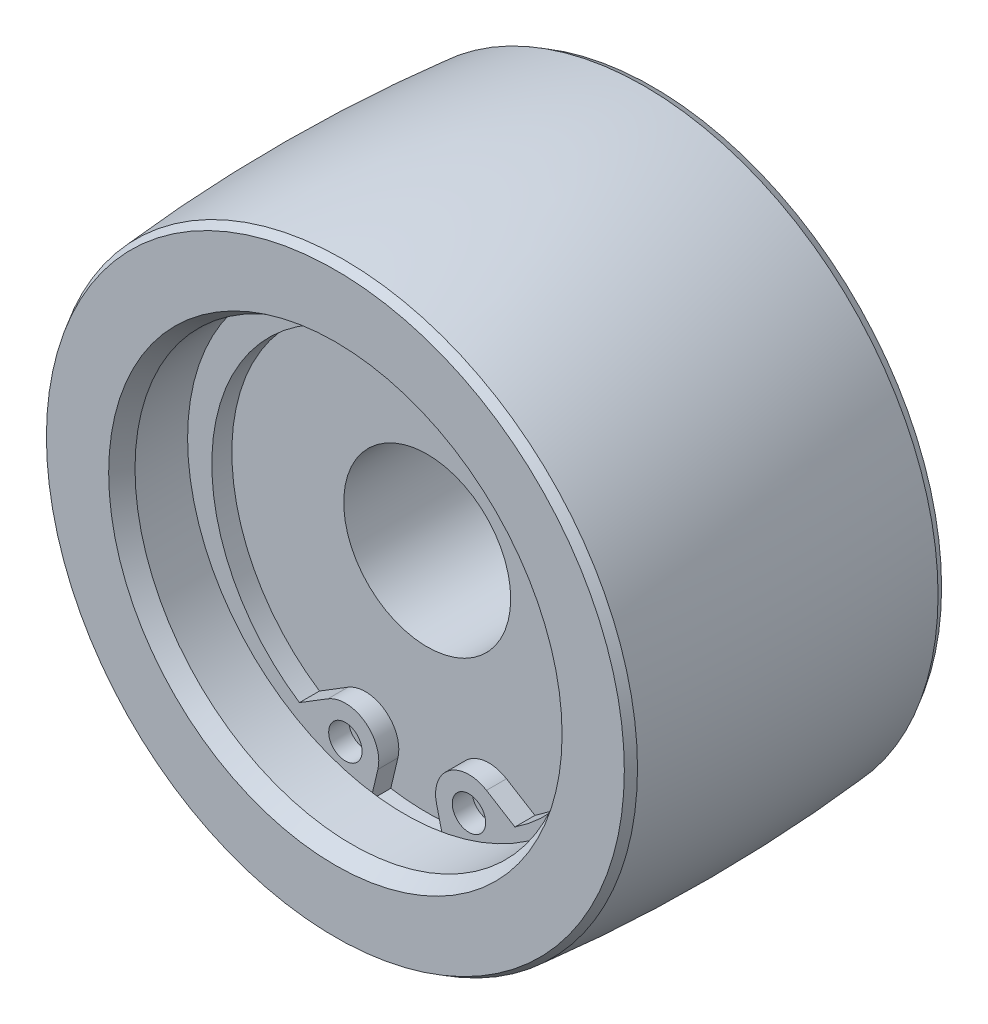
ISO-10303-21;
HEADER;
FILE_DESCRIPTION(('STEP AP214'),'2;1');
FILE_NAME('part.step','',(''),(''),'','','');
FILE_SCHEMA(('AUTOMOTIVE_DESIGN { 1 0 10303 214 1 1 1 1 }'));
ENDSEC;
DATA;
#1=APPLICATION_CONTEXT('core data for automotive mechanical design processes');
#2=APPLICATION_PROTOCOL_DEFINITION('international standard','automotive_design',2000,#1);
#3=PRODUCT_CONTEXT('',#1,'mechanical');
#4=PRODUCT('Part','Part','',(#3));
#5=PRODUCT_RELATED_PRODUCT_CATEGORY('part','',(#4));
#6=PRODUCT_DEFINITION_FORMATION('','',#4);
#7=PRODUCT_DEFINITION_CONTEXT('part definition',#1,'design');
#8=PRODUCT_DEFINITION('design','',#6,#7);
#9=PRODUCT_DEFINITION_SHAPE('','',#8);
#10=(LENGTH_UNIT() NAMED_UNIT(*) SI_UNIT(.MILLI.,.METRE.));
#11=(NAMED_UNIT(*) PLANE_ANGLE_UNIT() SI_UNIT($,.RADIAN.));
#12=(NAMED_UNIT(*) SI_UNIT($,.STERADIAN.) SOLID_ANGLE_UNIT());
#13=UNCERTAINTY_MEASURE_WITH_UNIT(LENGTH_MEASURE(1.E-05),#10,'distance_accuracy_value','');
#14=(GEOMETRIC_REPRESENTATION_CONTEXT(3) GLOBAL_UNCERTAINTY_ASSIGNED_CONTEXT((#13)) GLOBAL_UNIT_ASSIGNED_CONTEXT((#10,
#11,#12)) REPRESENTATION_CONTEXT('',''));
#15=CARTESIAN_POINT('',(0.,0.,0.));
#16=DIRECTION('',(0.,0.,1.));
#17=DIRECTION('',(1.,0.,0.));
#18=AXIS2_PLACEMENT_3D('',#15,#16,#17);
#19=CARTESIAN_POINT('',(0.,0.,0.));
#20=DIRECTION('',(0.,0.,-1.));
#21=DIRECTION('',(-1.,0.,0.));
#22=AXIS2_PLACEMENT_3D('',#19,#20,#21);
#23=DEGENERATE_TOROIDAL_SURFACE('',#22,82.,100.,.F.);
#24=CARTESIAN_POINT('',(0.,0.,-8.99999999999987));
#25=DIRECTION('',(0.,0.,-1.));
#26=DIRECTION('',(-1.,0.,0.));
#27=AXIS2_PLACEMENT_3D('',#24,#25,#26);
#28=CIRCLE('',#27,17.5941765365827);
#29=CARTESIAN_POINT('',(-17.5941765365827,0.,-8.99999999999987));
#30=VERTEX_POINT('',#29);
#31=EDGE_CURVE('E186',#30,#30,#28,.F.);
#32=ORIENTED_EDGE('',*,*,#31,.T.);
#33=EDGE_LOOP('',(#32));
#34=FACE_BOUND('',#33,.T.);
#35=CARTESIAN_POINT('',(0.,0.,9.));
#36=DIRECTION('',(0.,0.,1.));
#37=DIRECTION('',(1.,0.,0.));
#38=AXIS2_PLACEMENT_3D('',#35,#36,#37);
#39=CIRCLE('',#38,17.5941765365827);
#40=CARTESIAN_POINT('',(17.5941765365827,0.,9.));
#41=VERTEX_POINT('',#40);
#42=EDGE_CURVE('E190',#41,#41,#39,.F.);
#43=ORIENTED_EDGE('',*,*,#42,.T.);
#44=EDGE_LOOP('',(#43));
#45=FACE_BOUND('',#44,.T.);
#46=ADVANCED_FACE('F14',(#34,#45),#23,.F.);
#47=CARTESIAN_POINT('',(0.,0.,-8.49999999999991));
#48=DIRECTION('',(0.,0.,1.));
#49=DIRECTION('',(1.,0.,0.));
#50=AXIS2_PLACEMENT_3D('',#47,#48,#49);
#51=CONICAL_SURFACE('',#50,17.8828516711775,0.523598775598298);
#52=CARTESIAN_POINT('',(0.,0.,-9.5));
#53=DIRECTION('',(0.,0.,-1.));
#54=DIRECTION('',(-1.,0.,0.));
#55=AXIS2_PLACEMENT_3D('',#52,#53,#54);
#56=CIRCLE('',#55,17.3055014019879);
#57=CARTESIAN_POINT('',(-17.3055014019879,0.,-9.5));
#58=VERTEX_POINT('',#57);
#59=EDGE_CURVE('E183',#58,#58,#56,.T.);
#60=ORIENTED_EDGE('',*,*,#59,.F.);
#61=EDGE_LOOP('',(#60));
#62=FACE_BOUND('',#61,.T.);
#63=ORIENTED_EDGE('',*,*,#31,.F.);
#64=EDGE_LOOP('',(#63));
#65=FACE_BOUND('',#64,.T.);
#66=ADVANCED_FACE('F213',(#62,#65),#51,.T.);
#67=CARTESIAN_POINT('',(0.,0.,9.5));
#68=DIRECTION('',(0.,0.,-1.));
#69=DIRECTION('',(-1.,0.,0.));
#70=AXIS2_PLACEMENT_3D('',#67,#68,#69);
#71=CONICAL_SURFACE('',#70,17.3055014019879,0.523598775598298);
#72=CARTESIAN_POINT('',(0.,0.,9.5));
#73=DIRECTION('',(0.,0.,-1.));
#74=DIRECTION('',(-1.,0.,0.));
#75=AXIS2_PLACEMENT_3D('',#72,#73,#74);
#76=CIRCLE('',#75,17.3055014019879);
#77=CARTESIAN_POINT('',(-17.3055014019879,0.,9.5));
#78=VERTEX_POINT('',#77);
#79=EDGE_CURVE('E187',#78,#78,#76,.T.);
#80=ORIENTED_EDGE('',*,*,#79,.T.);
#81=EDGE_LOOP('',(#80));
#82=FACE_BOUND('',#81,.T.);
#83=ORIENTED_EDGE('',*,*,#42,.F.);
#84=EDGE_LOOP('',(#83));
#85=FACE_BOUND('',#84,.T.);
#86=ADVANCED_FACE('F215',(#82,#85),#71,.T.);
#87=CARTESIAN_POINT('',(0.,0.,-9.5));
#88=DIRECTION('',(0.,0.,1.));
#89=DIRECTION('',(1.,0.,0.));
#90=AXIS2_PLACEMENT_3D('',#87,#88,#89);
#91=PLANE('',#90);
#92=ORIENTED_EDGE('',*,*,#59,.T.);
#93=EDGE_LOOP('',(#92));
#94=FACE_BOUND('',#93,.T.);
#95=CARTESIAN_POINT('',(0.,0.,-9.5));
#96=DIRECTION('',(0.,0.,-1.));
#97=DIRECTION('',(-1.,0.,0.));
#98=AXIS2_PLACEMENT_3D('',#95,#96,#97);
#99=CIRCLE('',#98,11.);
#100=CARTESIAN_POINT('',(-11.,0.,-9.5));
#101=VERTEX_POINT('',#100);
#102=EDGE_CURVE('E203',#101,#101,#99,.T.);
#103=ORIENTED_EDGE('',*,*,#102,.F.);
#104=EDGE_LOOP('',(#103));
#105=FACE_BOUND('',#104,.T.);
#106=ADVANCED_FACE('F223',(#94,#105),#91,.F.);
#107=CARTESIAN_POINT('',(0.,0.,9.5));
#108=DIRECTION('',(0.,0.,1.));
#109=DIRECTION('',(1.,0.,0.));
#110=AXIS2_PLACEMENT_3D('',#107,#108,#109);
#111=PLANE('',#110);
#112=ORIENTED_EDGE('',*,*,#79,.F.);
#113=EDGE_LOOP('',(#112));
#114=FACE_BOUND('',#113,.T.);
#115=CARTESIAN_POINT('',(0.,0.,9.5));
#116=DIRECTION('',(0.,0.,-1.));
#117=DIRECTION('',(-1.,0.,0.));
#118=AXIS2_PLACEMENT_3D('',#115,#116,#117);
#119=CIRCLE('',#118,13.5773502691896);
#120=CARTESIAN_POINT('',(-13.5773502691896,0.,9.5));
#121=VERTEX_POINT('',#120);
#122=EDGE_CURVE('E191',#121,#121,#119,.T.);
#123=ORIENTED_EDGE('',*,*,#122,.T.);
#124=EDGE_LOOP('',(#123));
#125=FACE_BOUND('',#124,.T.);
#126=ADVANCED_FACE('F306',(#114,#125),#111,.T.);
#127=CARTESIAN_POINT('',(0.,0.,-10.45));
#128=DIRECTION('',(0.,0.,-1.));
#129=DIRECTION('',(-1.,0.,0.));
#130=AXIS2_PLACEMENT_3D('',#127,#128,#129);
#131=CYLINDRICAL_SURFACE('',#130,11.);
#132=CARTESIAN_POINT('',(0.,0.,-4.));
#133=DIRECTION('',(0.,0.,1.));
#134=DIRECTION('',(1.,0.,0.));
#135=AXIS2_PLACEMENT_3D('',#132,#133,#134);
#136=CIRCLE('',#135,11.);
#137=CARTESIAN_POINT('',(11.,0.,-4.));
#138=VERTEX_POINT('',#137);
#139=EDGE_CURVE('E174',#138,#138,#136,.T.);
#140=ORIENTED_EDGE('',*,*,#139,.T.);
#141=EDGE_LOOP('',(#140));
#142=FACE_BOUND('',#141,.T.);
#143=ORIENTED_EDGE('',*,*,#102,.T.);
#144=EDGE_LOOP('',(#143));
#145=FACE_BOUND('',#144,.T.);
#146=ADVANCED_FACE('F295',(#142,#145),#131,.F.);
#147=CARTESIAN_POINT('',(0.,0.,8.5));
#148=DIRECTION('',(0.,0.,1.));
#149=DIRECTION('',(1.,0.,0.));
#150=AXIS2_PLACEMENT_3D('',#147,#148,#149);
#151=CONICAL_SURFACE('',#150,13.,0.523598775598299);
#152=ORIENTED_EDGE('',*,*,#122,.F.);
#153=EDGE_LOOP('',(#152));
#154=FACE_BOUND('',#153,.T.);
#155=CARTESIAN_POINT('',(0.,0.,8.5));
#156=DIRECTION('',(0.,0.,-1.));
#157=DIRECTION('',(-1.,0.,0.));
#158=AXIS2_PLACEMENT_3D('',#155,#156,#157);
#159=CIRCLE('',#158,13.);
#160=CARTESIAN_POINT('',(-13.,0.,8.5));
#161=VERTEX_POINT('',#160);
#162=EDGE_CURVE('E194',#161,#161,#159,.T.);
#163=ORIENTED_EDGE('',*,*,#162,.T.);
#164=EDGE_LOOP('',(#163));
#165=FACE_BOUND('',#164,.T.);
#166=ADVANCED_FACE('F287',(#154,#165),#151,.F.);
#167=CARTESIAN_POINT('',(0.,5.,-4.));
#168=DIRECTION('',(0.,0.,1.));
#169=DIRECTION('',(1.,0.,0.));
#170=AXIS2_PLACEMENT_3D('',#167,#168,#169);
#171=PLANE('',#170);
#172=ORIENTED_EDGE('',*,*,#139,.F.);
#173=EDGE_LOOP('',(#172));
#174=FACE_BOUND('',#173,.T.);
#175=CARTESIAN_POINT('',(0.,0.,-4.));
#176=DIRECTION('',(0.,0.,1.));
#177=DIRECTION('',(1.,0.,0.));
#178=AXIS2_PLACEMENT_3D('',#175,#176,#177);
#179=CIRCLE('',#178,5.);
#180=CARTESIAN_POINT('',(5.,0.,-4.));
#181=VERTEX_POINT('',#180);
#182=EDGE_CURVE('E180',#181,#181,#179,.T.);
#183=ORIENTED_EDGE('',*,*,#182,.T.);
#184=EDGE_LOOP('',(#183));
#185=FACE_BOUND('',#184,.T.);
#186=ADVANCED_FACE('F285',(#174,#185),#171,.F.);
#187=CARTESIAN_POINT('',(0.,0.,-10.45));
#188=DIRECTION('',(0.,0.,-1.));
#189=DIRECTION('',(-1.,0.,0.));
#190=AXIS2_PLACEMENT_3D('',#187,#188,#189);
#191=CYLINDRICAL_SURFACE('',#190,13.);
#192=ORIENTED_EDGE('',*,*,#162,.F.);
#193=EDGE_LOOP('',(#192));
#194=FACE_BOUND('',#193,.T.);
#195=CARTESIAN_POINT('',(0.,0.,5.35));
#196=DIRECTION('',(0.,0.,-1.));
#197=DIRECTION('',(-1.,0.,0.));
#198=AXIS2_PLACEMENT_3D('',#195,#196,#197);
#199=CIRCLE('',#198,13.);
#200=CARTESIAN_POINT('',(-13.,0.,5.35));
#201=VERTEX_POINT('',#200);
#202=EDGE_CURVE('E197',#201,#201,#199,.T.);
#203=ORIENTED_EDGE('',*,*,#202,.T.);
#204=EDGE_LOOP('',(#203));
#205=FACE_BOUND('',#204,.T.);
#206=ADVANCED_FACE('F283',(#194,#205),#191,.F.);
#207=CARTESIAN_POINT('',(0.,0.,-46.));
#208=DIRECTION('',(0.,0.,1.));
#209=DIRECTION('',(1.,0.,0.));
#210=AXIS2_PLACEMENT_3D('',#207,#208,#209);
#211=CYLINDRICAL_SURFACE('',#210,5.);
#212=ORIENTED_EDGE('',*,*,#182,.F.);
#213=EDGE_LOOP('',(#212));
#214=FACE_BOUND('',#213,.T.);
#215=CARTESIAN_POINT('',(0.,0.,4.));
#216=DIRECTION('',(0.,0.,1.));
#217=DIRECTION('',(1.,0.,0.));
#218=AXIS2_PLACEMENT_3D('',#215,#216,#217);
#219=CIRCLE('',#218,5.);
#220=CARTESIAN_POINT('',(5.,0.,4.));
#221=VERTEX_POINT('',#220);
#222=EDGE_CURVE('E177',#221,#221,#219,.T.);
#223=ORIENTED_EDGE('',*,*,#222,.T.);
#224=EDGE_LOOP('',(#223));
#225=FACE_BOUND('',#224,.T.);
#226=ADVANCED_FACE('F280',(#214,#225),#211,.F.);
#227=CARTESIAN_POINT('',(0.,8.,4.));
#228=DIRECTION('',(0.,0.,-1.));
#229=DIRECTION('',(-1.,0.,0.));
#230=AXIS2_PLACEMENT_3D('',#227,#228,#229);
#231=PLANE('',#230);
#232=ORIENTED_EDGE('',*,*,#222,.F.);
#233=EDGE_LOOP('',(#232));
#234=FACE_BOUND('',#233,.T.);
#235=DIRECTION('',(0.231349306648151,-0.972870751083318,0.));
#236=VECTOR('',#235,1.);
#237=CARTESIAN_POINT('',(-2.75736634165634,7.34429646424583,4.));
#238=LINE('',#237,#236);
#239=CARTESIAN_POINT('',(1.75425849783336,-11.6280009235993,4.));
#240=VERTEX_POINT('',#239);
#241=CARTESIAN_POINT('',(2.1813307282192,-13.4239262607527,4.));
#242=VERTEX_POINT('',#241);
#243=EDGE_CURVE('E9',#240,#242,#238,.T.);
#244=ORIENTED_EDGE('',*,*,#243,.F.);
#245=CARTESIAN_POINT('',(3.7,-11.165302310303,4.));
#246=DIRECTION('',(0.,0.,-1.));
#247=DIRECTION('',(-1.,0.,0.));
#248=AXIS2_PLACEMENT_3D('',#245,#246,#247);
#249=CIRCLE('',#248,2.);
#250=CARTESIAN_POINT('',(4.74866968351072,-9.46227797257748,4.));
#251=VERTEX_POINT('',#250);
#252=EDGE_CURVE('E25',#240,#251,#249,.T.);
#253=ORIENTED_EDGE('',*,*,#252,.T.);
#254=DIRECTION('',(-0.851512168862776,0.524334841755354,0.));
#255=VECTOR('',#254,1.);
#256=CARTESIAN_POINT('',(-6.49097654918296,-2.54125165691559,4.));
#257=LINE('',#256,#255);
#258=CARTESIAN_POINT('',(6.45127454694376,-10.5106893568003,4.));
#259=VERTEX_POINT('',#258);
#260=EDGE_CURVE('E140',#259,#251,#257,.T.);
#261=ORIENTED_EDGE('',*,*,#260,.F.);
#262=CARTESIAN_POINT('',(0.,-0.75,4.));
#263=DIRECTION('',(0.,0.,-1.));
#264=DIRECTION('',(-1.,0.,0.));
#265=AXIS2_PLACEMENT_3D('',#262,#263,#264);
#266=CIRCLE('',#265,11.7);
#267=CARTESIAN_POINT('',(-6.45127454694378,-10.5106893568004,4.));
#268=VERTEX_POINT('',#267);
#269=EDGE_CURVE('E143',#268,#259,#266,.T.);
#270=ORIENTED_EDGE('',*,*,#269,.F.);
#271=DIRECTION('',(-0.851512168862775,-0.524334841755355,0.));
#272=VECTOR('',#271,1.);
#273=CARTESIAN_POINT('',(6.49097654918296,-2.54125165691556,4.));
#274=LINE('',#273,#272);
#275=CARTESIAN_POINT('',(-4.74866968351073,-9.46227797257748,4.));
#276=VERTEX_POINT('',#275);
#277=EDGE_CURVE('E147',#276,#268,#274,.T.);
#278=ORIENTED_EDGE('',*,*,#277,.F.);
#279=CARTESIAN_POINT('',(-3.7,-11.165302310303,4.));
#280=DIRECTION('',(0.,0.,-1.));
#281=DIRECTION('',(-1.,0.,0.));
#282=AXIS2_PLACEMENT_3D('',#279,#280,#281);
#283=CIRCLE('',#282,2.);
#284=CARTESIAN_POINT('',(-1.75425849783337,-11.6280009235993,4.));
#285=VERTEX_POINT('',#284);
#286=EDGE_CURVE('E154',#276,#285,#283,.T.);
#287=ORIENTED_EDGE('',*,*,#286,.T.);
#288=DIRECTION('',(0.231349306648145,0.97287075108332,0.));
#289=VECTOR('',#288,1.);
#290=CARTESIAN_POINT('',(2.75736634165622,7.34429646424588,4.));
#291=LINE('',#290,#289);
#292=CARTESIAN_POINT('',(-2.18133072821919,-13.4239262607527,4.));
#293=VERTEX_POINT('',#292);
#294=EDGE_CURVE('E151',#293,#285,#291,.T.);
#295=ORIENTED_EDGE('',*,*,#294,.F.);
#296=CARTESIAN_POINT('',(0.,0.,4.));
#297=DIRECTION('',(0.,0.,-1.));
#298=DIRECTION('',(-1.,0.,0.));
#299=AXIS2_PLACEMENT_3D('',#296,#297,#298);
#300=CIRCLE('',#299,13.6);
#301=EDGE_CURVE('E171',#242,#293,#300,.T.);
#302=ORIENTED_EDGE('',*,*,#301,.F.);
#303=EDGE_LOOP('',(#244,#253,#261,#270,#278,#287,#295,#302));
#304=FACE_BOUND('',#303,.T.);
#305=ADVANCED_FACE('F243',(#234,#304),#231,.F.);
#306=CARTESIAN_POINT('',(0.,13.,5.35));
#307=DIRECTION('',(0.,0.,1.));
#308=DIRECTION('',(1.,0.,0.));
#309=AXIS2_PLACEMENT_3D('',#306,#307,#308);
#310=PLANE('',#309);
#311=ORIENTED_EDGE('',*,*,#202,.F.);
#312=EDGE_LOOP('',(#311));
#313=FACE_BOUND('',#312,.T.);
#314=CARTESIAN_POINT('',(0.,0.,5.35));
#315=DIRECTION('',(0.,0.,-1.));
#316=DIRECTION('',(-1.,0.,0.));
#317=AXIS2_PLACEMENT_3D('',#314,#315,#316);
#318=CIRCLE('',#317,13.6);
#319=CARTESIAN_POINT('',(-13.6,0.,5.35));
#320=VERTEX_POINT('',#319);
#321=EDGE_CURVE('E200',#320,#320,#318,.T.);
#322=ORIENTED_EDGE('',*,*,#321,.T.);
#323=EDGE_LOOP('',(#322));
#324=FACE_BOUND('',#323,.T.);
#325=ADVANCED_FACE('F279',(#313,#324),#310,.F.);
#326=CARTESIAN_POINT('',(0.,0.,-10.45));
#327=DIRECTION('',(0.,0.,-1.));
#328=DIRECTION('',(-1.,0.,0.));
#329=AXIS2_PLACEMENT_3D('',#326,#327,#328);
#330=CYLINDRICAL_SURFACE('',#329,13.6);
#331=ORIENTED_EDGE('',*,*,#321,.F.);
#332=EDGE_LOOP('',(#331));
#333=FACE_BOUND('',#332,.T.);
#334=DIRECTION('',(0.,0.,-1.));
#335=VECTOR('',#334,1.);
#336=CARTESIAN_POINT('',(2.1813307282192,-13.4239262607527,-10.45));
#337=LINE('',#336,#335);
#338=CARTESIAN_POINT('',(2.1813307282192,-13.4239262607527,5.2));
#339=VERTEX_POINT('',#338);
#340=EDGE_CURVE('E85',#242,#339,#337,.F.);
#341=ORIENTED_EDGE('',*,*,#340,.F.);
#342=ORIENTED_EDGE('',*,*,#301,.T.);
#343=DIRECTION('',(0.,0.,-1.));
#344=VECTOR('',#343,1.);
#345=CARTESIAN_POINT('',(-2.18133072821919,-13.4239262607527,-10.45));
#346=LINE('',#345,#344);
#347=CARTESIAN_POINT('',(-2.18133072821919,-13.4239262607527,5.2));
#348=VERTEX_POINT('',#347);
#349=EDGE_CURVE('E168',#348,#293,#346,.T.);
#350=ORIENTED_EDGE('',*,*,#349,.F.);
#351=CARTESIAN_POINT('',(0.,0.,5.2));
#352=DIRECTION('',(0.,0.,-1.));
#353=DIRECTION('',(-1.,0.,0.));
#354=AXIS2_PLACEMENT_3D('',#351,#352,#353);
#355=CIRCLE('',#354,13.6);
#356=EDGE_CURVE('E166',#339,#348,#355,.F.);
#357=ORIENTED_EDGE('',*,*,#356,.F.);
#358=EDGE_LOOP('',(#341,#342,#350,#357));
#359=FACE_BOUND('',#358,.T.);
#360=ADVANCED_FACE('F319',(#333,#359),#330,.F.);
#361=CARTESIAN_POINT('',(3.7,-11.165302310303,4.));
#362=DIRECTION('',(0.,0.,-1.));
#363=DIRECTION('',(-1.,0.,0.));
#364=AXIS2_PLACEMENT_3D('',#361,#362,#363);
#365=CIRCLE('',#364,1.);
#366=CARTESIAN_POINT('',(2.7,-11.165302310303,4.));
#367=VERTEX_POINT('',#366);
#368=EDGE_CURVE('E162',#367,#367,#365,.T.);
#369=ORIENTED_EDGE('',*,*,#368,.F.);
#370=EDGE_LOOP('',(#369));
#371=FACE_BOUND('',#370,.T.);
#372=ADVANCED_FACE('F240',(#371),#231,.F.);
#373=CARTESIAN_POINT('',(-3.7,-11.165302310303,4.));
#374=DIRECTION('',(0.,0.,-1.));
#375=DIRECTION('',(-1.,0.,0.));
#376=AXIS2_PLACEMENT_3D('',#373,#374,#375);
#377=CIRCLE('',#376,1.);
#378=CARTESIAN_POINT('',(-4.7,-11.165302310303,4.));
#379=VERTEX_POINT('',#378);
#380=EDGE_CURVE('E158',#379,#379,#377,.T.);
#381=ORIENTED_EDGE('',*,*,#380,.F.);
#382=EDGE_LOOP('',(#381));
#383=FACE_BOUND('',#382,.T.);
#384=ADVANCED_FACE('F231',(#383),#231,.F.);
#385=CARTESIAN_POINT('',(4.74866968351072,-9.46227797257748,5.2));
#386=DIRECTION('',(-0.524334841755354,-0.851512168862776,0.));
#387=DIRECTION('',(-0.851512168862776,0.524334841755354,0.));
#388=AXIS2_PLACEMENT_3D('',#385,#386,#387);
#389=PLANE('',#388);
#390=ORIENTED_EDGE('',*,*,#260,.T.);
#391=DIRECTION('',(0.,0.,-1.));
#392=VECTOR('',#391,1.);
#393=CARTESIAN_POINT('',(4.74866968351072,-9.46227797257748,5.2));
#394=LINE('',#393,#392);
#395=CARTESIAN_POINT('',(4.74866968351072,-9.46227797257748,5.2));
#396=VERTEX_POINT('',#395);
#397=EDGE_CURVE('E100',#396,#251,#394,.T.);
#398=ORIENTED_EDGE('',*,*,#397,.F.);
#399=DIRECTION('',(-0.851512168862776,0.524334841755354,0.));
#400=VECTOR('',#399,1.);
#401=CARTESIAN_POINT('',(4.74866968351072,-9.46227797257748,5.2));
#402=LINE('',#401,#400);
#403=CARTESIAN_POINT('',(6.45127454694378,-10.5106893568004,5.2));
#404=VERTEX_POINT('',#403);
#405=EDGE_CURVE('E93',#404,#396,#402,.T.);
#406=ORIENTED_EDGE('',*,*,#405,.F.);
#407=DIRECTION('',(0.,0.,-1.));
#408=VECTOR('',#407,1.);
#409=CARTESIAN_POINT('',(6.45127454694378,-10.5106893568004,5.2));
#410=LINE('',#409,#408);
#411=EDGE_CURVE('E124',#404,#259,#410,.T.);
#412=ORIENTED_EDGE('',*,*,#411,.T.);
#413=EDGE_LOOP('',(#390,#398,#406,#412));
#414=FACE_BOUND('',#413,.T.);
#415=ADVANCED_FACE('F229',(#414),#389,.F.);
#416=CARTESIAN_POINT('',(0.,-0.75,5.2));
#417=DIRECTION('',(0.,0.,1.));
#418=DIRECTION('',(-1.,0.,0.));
#419=AXIS2_PLACEMENT_3D('',#416,#417,#418);
#420=CYLINDRICAL_SURFACE('',#419,11.7);
#421=ORIENTED_EDGE('',*,*,#269,.T.);
#422=ORIENTED_EDGE('',*,*,#411,.F.);
#423=CARTESIAN_POINT('',(0.,-0.75,5.2));
#424=DIRECTION('',(0.,0.,-1.));
#425=DIRECTION('',(0.,-1.,0.));
#426=AXIS2_PLACEMENT_3D('',#423,#424,#425);
#427=CIRCLE('',#426,11.7);
#428=CARTESIAN_POINT('',(-6.45127454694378,-10.5106893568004,5.2));
#429=VERTEX_POINT('',#428);
#430=EDGE_CURVE('E127',#429,#404,#427,.T.);
#431=ORIENTED_EDGE('',*,*,#430,.F.);
#432=DIRECTION('',(0.,0.,-1.));
#433=VECTOR('',#432,1.);
#434=CARTESIAN_POINT('',(-6.45127454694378,-10.5106893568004,5.2));
#435=LINE('',#434,#433);
#436=EDGE_CURVE('E120',#429,#268,#435,.T.);
#437=ORIENTED_EDGE('',*,*,#436,.T.);
#438=EDGE_LOOP('',(#421,#422,#431,#437));
#439=FACE_BOUND('',#438,.T.);
#440=ADVANCED_FACE('F16',(#439),#420,.F.);
#441=CARTESIAN_POINT('',(-4.74866968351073,-9.46227797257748,5.2));
#442=DIRECTION('',(0.524334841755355,-0.851512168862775,0.));
#443=DIRECTION('',(0.,0.,-1.));
#444=AXIS2_PLACEMENT_3D('',#441,#442,#443);
#445=PLANE('',#444);
#446=ORIENTED_EDGE('',*,*,#277,.T.);
#447=ORIENTED_EDGE('',*,*,#436,.F.);
#448=DIRECTION('',(-0.851512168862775,-0.524334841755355,0.));
#449=VECTOR('',#448,1.);
#450=CARTESIAN_POINT('',(-4.74866968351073,-9.46227797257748,5.2));
#451=LINE('',#450,#449);
#452=CARTESIAN_POINT('',(-4.74866968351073,-9.46227797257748,5.2));
#453=VERTEX_POINT('',#452);
#454=EDGE_CURVE('E128',#453,#429,#451,.T.);
#455=ORIENTED_EDGE('',*,*,#454,.F.);
#456=DIRECTION('',(0.,0.,-1.));
#457=VECTOR('',#456,1.);
#458=CARTESIAN_POINT('',(-4.74866968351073,-9.46227797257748,5.2));
#459=LINE('',#458,#457);
#460=EDGE_CURVE('E18',#453,#276,#459,.T.);
#461=ORIENTED_EDGE('',*,*,#460,.T.);
#462=EDGE_LOOP('',(#446,#447,#455,#461));
#463=FACE_BOUND('',#462,.T.);
#464=ADVANCED_FACE('F238',(#463),#445,.F.);
#465=CARTESIAN_POINT('',(3.7,-11.165302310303,5.2));
#466=DIRECTION('',(0.,0.,1.));
#467=DIRECTION('',(-1.,0.,0.));
#468=AXIS2_PLACEMENT_3D('',#465,#466,#467);
#469=CYLINDRICAL_SURFACE('',#468,1.);
#470=ORIENTED_EDGE('',*,*,#368,.T.);
#471=EDGE_LOOP('',(#470));
#472=FACE_BOUND('',#471,.T.);
#473=CARTESIAN_POINT('',(3.7,-11.165302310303,5.2));
#474=DIRECTION('',(0.,0.,1.));
#475=DIRECTION('',(1.,0.,0.));
#476=AXIS2_PLACEMENT_3D('',#473,#474,#475);
#477=CIRCLE('',#476,1.);
#478=CARTESIAN_POINT('',(4.7,-11.165302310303,5.2));
#479=VERTEX_POINT('',#478);
#480=EDGE_CURVE('E108',#479,#479,#477,.T.);
#481=ORIENTED_EDGE('',*,*,#480,.T.);
#482=EDGE_LOOP('',(#481));
#483=FACE_BOUND('',#482,.T.);
#484=ADVANCED_FACE('F249',(#472,#483),#469,.F.);
#485=CARTESIAN_POINT('',(-3.7,-11.165302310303,5.2));
#486=DIRECTION('',(0.,0.,1.));
#487=DIRECTION('',(-1.,0.,0.));
#488=AXIS2_PLACEMENT_3D('',#485,#486,#487);
#489=CYLINDRICAL_SURFACE('',#488,1.);
#490=ORIENTED_EDGE('',*,*,#380,.T.);
#491=EDGE_LOOP('',(#490));
#492=FACE_BOUND('',#491,.T.);
#493=CARTESIAN_POINT('',(-3.7,-11.165302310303,5.2));
#494=DIRECTION('',(0.,0.,-1.));
#495=DIRECTION('',(1.,0.,0.));
#496=AXIS2_PLACEMENT_3D('',#493,#494,#495);
#497=CIRCLE('',#496,1.);
#498=CARTESIAN_POINT('',(-2.7,-11.165302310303,5.2));
#499=VERTEX_POINT('',#498);
#500=EDGE_CURVE('E105',#499,#499,#497,.T.);
#501=ORIENTED_EDGE('',*,*,#500,.F.);
#502=EDGE_LOOP('',(#501));
#503=FACE_BOUND('',#502,.T.);
#504=ADVANCED_FACE('F246',(#492,#503),#489,.F.);
#505=CARTESIAN_POINT('',(3.7,-11.165302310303,5.2));
#506=DIRECTION('',(0.,0.,1.));
#507=DIRECTION('',(-1.,0.,0.));
#508=AXIS2_PLACEMENT_3D('',#505,#506,#507);
#509=CYLINDRICAL_SURFACE('',#508,2.);
#510=ORIENTED_EDGE('',*,*,#252,.F.);
#511=DIRECTION('',(0.,0.,-1.));
#512=VECTOR('',#511,1.);
#513=CARTESIAN_POINT('',(1.75425849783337,-11.6280009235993,5.2));
#514=LINE('',#513,#512);
#515=CARTESIAN_POINT('',(1.75425849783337,-11.6280009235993,5.2));
#516=VERTEX_POINT('',#515);
#517=EDGE_CURVE('E82',#516,#240,#514,.T.);
#518=ORIENTED_EDGE('',*,*,#517,.F.);
#519=CARTESIAN_POINT('',(3.7,-11.165302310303,5.2));
#520=DIRECTION('',(0.,0.,1.));
#521=DIRECTION('',(1.,0.,0.));
#522=AXIS2_PLACEMENT_3D('',#519,#520,#521);
#523=CIRCLE('',#522,2.);
#524=EDGE_CURVE('E87',#396,#516,#523,.T.);
#525=ORIENTED_EDGE('',*,*,#524,.F.);
#526=ORIENTED_EDGE('',*,*,#397,.T.);
#527=EDGE_LOOP('',(#510,#518,#525,#526));
#528=FACE_BOUND('',#527,.T.);
#529=ADVANCED_FACE('F98',(#528),#509,.T.);
#530=CARTESIAN_POINT('',(-3.7,-11.165302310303,5.2));
#531=DIRECTION('',(0.,0.,1.));
#532=DIRECTION('',(-1.,0.,0.));
#533=AXIS2_PLACEMENT_3D('',#530,#531,#532);
#534=CYLINDRICAL_SURFACE('',#533,2.);
#535=ORIENTED_EDGE('',*,*,#286,.F.);
#536=ORIENTED_EDGE('',*,*,#460,.F.);
#537=CARTESIAN_POINT('',(-3.7,-11.165302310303,5.2));
#538=DIRECTION('',(0.,0.,1.));
#539=DIRECTION('',(-1.,0.,0.));
#540=AXIS2_PLACEMENT_3D('',#537,#538,#539);
#541=CIRCLE('',#540,2.);
#542=CARTESIAN_POINT('',(-1.75425849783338,-11.6280009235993,5.2));
#543=VERTEX_POINT('',#542);
#544=EDGE_CURVE('E113',#543,#453,#541,.T.);
#545=ORIENTED_EDGE('',*,*,#544,.F.);
#546=DIRECTION('',(0.,0.,-1.));
#547=VECTOR('',#546,1.);
#548=CARTESIAN_POINT('',(-1.75425849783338,-11.6280009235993,5.2));
#549=LINE('',#548,#547);
#550=EDGE_CURVE('E101',#543,#285,#549,.T.);
#551=ORIENTED_EDGE('',*,*,#550,.T.);
#552=EDGE_LOOP('',(#535,#536,#545,#551));
#553=FACE_BOUND('',#552,.T.);
#554=ADVANCED_FACE('F253',(#553),#534,.T.);
#555=CARTESIAN_POINT('',(0.,-0.75,5.2));
#556=DIRECTION('',(0.,0.,-1.));
#557=DIRECTION('',(0.,-1.,0.));
#558=AXIS2_PLACEMENT_3D('',#555,#556,#557);
#559=PLANE('',#558);
#560=ORIENTED_EDGE('',*,*,#500,.T.);
#561=EDGE_LOOP('',(#560));
#562=FACE_BOUND('',#561,.T.);
#563=ORIENTED_EDGE('',*,*,#480,.F.);
#564=EDGE_LOOP('',(#563));
#565=FACE_BOUND('',#564,.T.);
#566=DIRECTION('',(0.231349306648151,-0.972870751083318,0.));
#567=VECTOR('',#566,1.);
#568=CARTESIAN_POINT('',(1.75425849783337,-11.6280009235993,5.2));
#569=LINE('',#568,#567);
#570=EDGE_CURVE('E78',#516,#339,#569,.T.);
#571=ORIENTED_EDGE('',*,*,#570,.T.);
#572=ORIENTED_EDGE('',*,*,#356,.T.);
#573=DIRECTION('',(0.231349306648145,0.97287075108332,0.));
#574=VECTOR('',#573,1.);
#575=CARTESIAN_POINT('',(-1.75425849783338,-11.6280009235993,5.2));
#576=LINE('',#575,#574);
#577=EDGE_CURVE('E70',#348,#543,#576,.T.);
#578=ORIENTED_EDGE('',*,*,#577,.T.);
#579=ORIENTED_EDGE('',*,*,#544,.T.);
#580=ORIENTED_EDGE('',*,*,#454,.T.);
#581=ORIENTED_EDGE('',*,*,#430,.T.);
#582=ORIENTED_EDGE('',*,*,#405,.T.);
#583=ORIENTED_EDGE('',*,*,#524,.T.);
#584=EDGE_LOOP('',(#571,#572,#578,#579,#580,#581,#582,#583));
#585=FACE_BOUND('',#584,.T.);
#586=ADVANCED_FACE('F91',(#562,#565,#585),#559,.F.);
#587=CARTESIAN_POINT('',(-1.75425849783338,-11.6280009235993,5.2));
#588=DIRECTION('',(-0.97287075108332,0.231349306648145,0.));
#589=DIRECTION('',(0.,0.,1.));
#590=AXIS2_PLACEMENT_3D('',#587,#588,#589);
#591=PLANE('',#590);
#592=ORIENTED_EDGE('',*,*,#577,.F.);
#593=ORIENTED_EDGE('',*,*,#349,.T.);
#594=ORIENTED_EDGE('',*,*,#294,.T.);
#595=ORIENTED_EDGE('',*,*,#550,.F.);
#596=EDGE_LOOP('',(#592,#593,#594,#595));
#597=FACE_BOUND('',#596,.T.);
#598=ADVANCED_FACE('F252',(#597),#591,.F.);
#599=CARTESIAN_POINT('',(1.75425849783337,-11.6280009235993,5.2));
#600=DIRECTION('',(0.972870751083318,0.231349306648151,0.));
#601=DIRECTION('',(0.,0.,-1.));
#602=AXIS2_PLACEMENT_3D('',#599,#600,#601);
#603=PLANE('',#602);
#604=ORIENTED_EDGE('',*,*,#243,.T.);
#605=ORIENTED_EDGE('',*,*,#340,.T.);
#606=ORIENTED_EDGE('',*,*,#570,.F.);
#607=ORIENTED_EDGE('',*,*,#517,.T.);
#608=EDGE_LOOP('',(#604,#605,#606,#607));
#609=FACE_BOUND('',#608,.T.);
#610=ADVANCED_FACE('F80',(#609),#603,.F.);
#611=CLOSED_SHELL('',(#46,#66,#86,#106,#126,#146,#166,#186,#206,#226,#305,#325,#360,#372,#384,
#415,#440,#464,#484,#504,#529,#554,#586,#598,#610));
#612=MANIFOLD_SOLID_BREP('B1',#611);
#613=ADVANCED_BREP_SHAPE_REPRESENTATION('',(#18,#612),#14);
#614=SHAPE_DEFINITION_REPRESENTATION(#9,#613);
ENDSEC;
END-ISO-10303-21;
